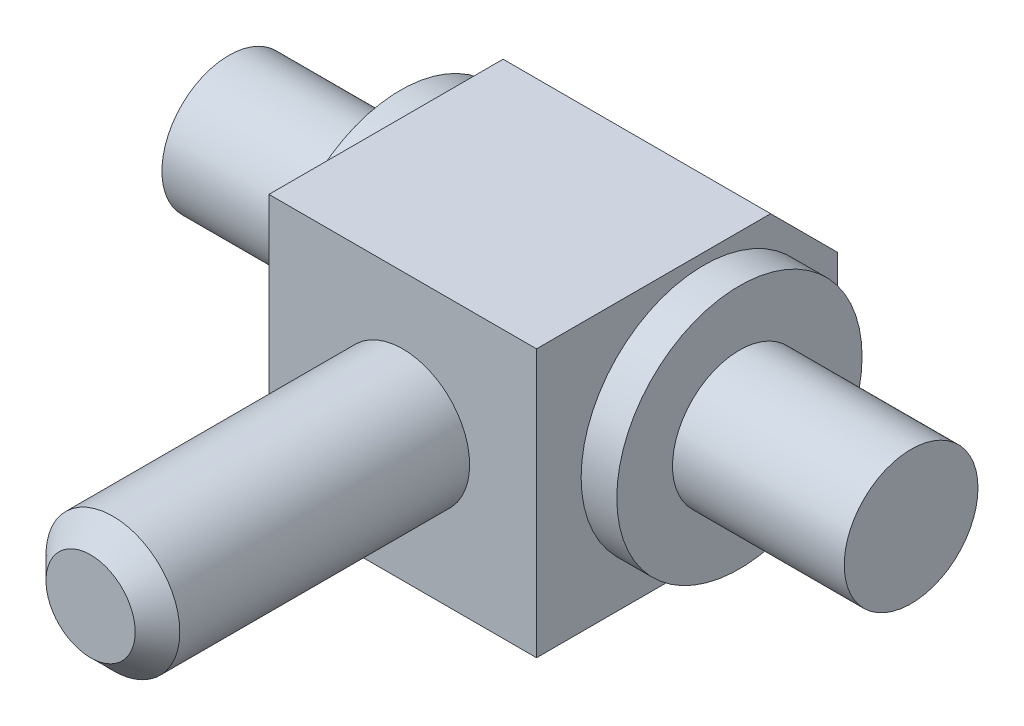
ISO-10303-21;
HEADER;
FILE_DESCRIPTION(('STEP AP214'),'2;1');
FILE_NAME('part.step','',(''),(''),'','','');
FILE_SCHEMA(('AUTOMOTIVE_DESIGN { 1 0 10303 214 1 1 1 1 }'));
ENDSEC;
DATA;
#1=APPLICATION_CONTEXT('core data for automotive mechanical design processes');
#2=APPLICATION_PROTOCOL_DEFINITION('international standard','automotive_design',2000,#1);
#3=PRODUCT_CONTEXT('',#1,'mechanical');
#4=PRODUCT('Part','Part','',(#3));
#5=PRODUCT_RELATED_PRODUCT_CATEGORY('part','',(#4));
#6=PRODUCT_DEFINITION_FORMATION('','',#4);
#7=PRODUCT_DEFINITION_CONTEXT('part definition',#1,'design');
#8=PRODUCT_DEFINITION('design','',#6,#7);
#9=PRODUCT_DEFINITION_SHAPE('','',#8);
#10=(LENGTH_UNIT() NAMED_UNIT(*) SI_UNIT(.MILLI.,.METRE.));
#11=(NAMED_UNIT(*) PLANE_ANGLE_UNIT() SI_UNIT($,.RADIAN.));
#12=(NAMED_UNIT(*) SI_UNIT($,.STERADIAN.) SOLID_ANGLE_UNIT());
#13=UNCERTAINTY_MEASURE_WITH_UNIT(LENGTH_MEASURE(1.E-05),#10,'distance_accuracy_value','');
#14=(GEOMETRIC_REPRESENTATION_CONTEXT(3) GLOBAL_UNCERTAINTY_ASSIGNED_CONTEXT((#13)) GLOBAL_UNIT_ASSIGNED_CONTEXT((#10,
#11,#12)) REPRESENTATION_CONTEXT('',''));
#15=CARTESIAN_POINT('',(0.,0.,0.));
#16=DIRECTION('',(0.,0.,1.));
#17=DIRECTION('',(1.,0.,0.));
#18=AXIS2_PLACEMENT_3D('',#15,#16,#17);
#19=CARTESIAN_POINT('',(-6.,6.,7.));
#20=DIRECTION('',(1.,0.,0.));
#21=DIRECTION('',(0.,0.,1.));
#22=AXIS2_PLACEMENT_3D('',#19,#20,#21);
#23=PLANE('',#22);
#24=DIRECTION('',(0.,1.,0.));
#25=VECTOR('',#24,1.);
#26=CARTESIAN_POINT('',(-6.,-6.,-6.));
#27=LINE('',#26,#25);
#28=CARTESIAN_POINT('',(-6.,-3.,-6.));
#29=VERTEX_POINT('',#28);
#30=CARTESIAN_POINT('',(-6.,2.99999999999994,-6.));
#31=VERTEX_POINT('',#30);
#32=EDGE_CURVE('E120',#29,#31,#27,.T.);
#33=ORIENTED_EDGE('',*,*,#32,.F.);
#34=DIRECTION('',(0.,-0.707106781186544,0.707106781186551));
#35=VECTOR('',#34,1.);
#36=CARTESIAN_POINT('',(-6.,-6.,-3.));
#37=LINE('',#36,#35);
#38=CARTESIAN_POINT('',(-6.,-6.,-3.));
#39=VERTEX_POINT('',#38);
#40=EDGE_CURVE('E135',#29,#39,#37,.T.);
#41=ORIENTED_EDGE('',*,*,#40,.T.);
#42=DIRECTION('',(0.,0.,1.));
#43=VECTOR('',#42,1.);
#44=CARTESIAN_POINT('',(-6.,-6.,-6.));
#45=LINE('',#44,#43);
#46=CARTESIAN_POINT('',(-6.,-6.,7.5));
#47=VERTEX_POINT('',#46);
#48=EDGE_CURVE('E77',#39,#47,#45,.T.);
#49=ORIENTED_EDGE('',*,*,#48,.T.);
#50=DIRECTION('',(0.,-1.,0.));
#51=VECTOR('',#50,1.);
#52=CARTESIAN_POINT('',(-6.,6.,7.5));
#53=LINE('',#52,#51);
#54=CARTESIAN_POINT('',(-6.,6.,7.5));
#55=VERTEX_POINT('',#54);
#56=EDGE_CURVE('E87',#55,#47,#53,.T.);
#57=ORIENTED_EDGE('',*,*,#56,.F.);
#58=DIRECTION('',(0.,0.,-1.));
#59=VECTOR('',#58,1.);
#60=CARTESIAN_POINT('',(-6.,6.,7.));
#61=LINE('',#60,#59);
#62=CARTESIAN_POINT('',(-6.,6.,-3.));
#63=VERTEX_POINT('',#62);
#64=EDGE_CURVE('E83',#55,#63,#61,.T.);
#65=ORIENTED_EDGE('',*,*,#64,.T.);
#66=DIRECTION('',(0.,-0.707106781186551,-0.707106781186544));
#67=VECTOR('',#66,1.);
#68=CARTESIAN_POINT('',(-6.,2.99999999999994,-6.));
#69=LINE('',#68,#67);
#70=EDGE_CURVE('E36',#63,#31,#69,.T.);
#71=ORIENTED_EDGE('',*,*,#70,.T.);
#72=EDGE_LOOP('',(#33,#41,#49,#57,#65,#71));
#73=FACE_BOUND('',#72,.T.);
#74=CARTESIAN_POINT('',(-6.,0.,0.));
#75=DIRECTION('',(1.,0.,0.));
#76=DIRECTION('',(0.,0.,1.));
#77=AXIS2_PLACEMENT_3D('',#74,#75,#76);
#78=CIRCLE('',#77,5.5);
#79=CARTESIAN_POINT('',(-6.,0.,5.5));
#80=VERTEX_POINT('',#79);
#81=EDGE_CURVE('E105',#80,#80,#78,.F.);
#82=ORIENTED_EDGE('',*,*,#81,.F.);
#83=EDGE_LOOP('',(#82));
#84=FACE_BOUND('',#83,.T.);
#85=ADVANCED_FACE('F14',(#73,#84),#23,.F.);
#86=CARTESIAN_POINT('',(6.,6.,7.));
#87=DIRECTION('',(1.,0.,0.));
#88=DIRECTION('',(0.,0.,1.));
#89=AXIS2_PLACEMENT_3D('',#86,#87,#88);
#90=PLANE('',#89);
#91=DIRECTION('',(0.,0.,1.));
#92=VECTOR('',#91,1.);
#93=CARTESIAN_POINT('',(6.,-6.,-6.));
#94=LINE('',#93,#92);
#95=CARTESIAN_POINT('',(6.,-6.,-3.));
#96=VERTEX_POINT('',#95);
#97=CARTESIAN_POINT('',(6.,-6.,7.5));
#98=VERTEX_POINT('',#97);
#99=EDGE_CURVE('E116',#96,#98,#94,.T.);
#100=ORIENTED_EDGE('',*,*,#99,.F.);
#101=DIRECTION('',(0.,0.707106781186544,-0.707106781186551));
#102=VECTOR('',#101,1.);
#103=CARTESIAN_POINT('',(6.,-5.,-4.));
#104=LINE('',#103,#102);
#105=CARTESIAN_POINT('',(6.,-3.,-6.));
#106=VERTEX_POINT('',#105);
#107=EDGE_CURVE('E127',#96,#106,#104,.T.);
#108=ORIENTED_EDGE('',*,*,#107,.T.);
#109=DIRECTION('',(0.,1.,0.));
#110=VECTOR('',#109,1.);
#111=CARTESIAN_POINT('',(6.,-6.,-6.));
#112=LINE('',#111,#110);
#113=CARTESIAN_POINT('',(6.,2.99999999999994,-6.));
#114=VERTEX_POINT('',#113);
#115=EDGE_CURVE('E78',#106,#114,#112,.T.);
#116=ORIENTED_EDGE('',*,*,#115,.T.);
#117=DIRECTION('',(0.,0.707106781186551,0.707106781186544));
#118=VECTOR('',#117,1.);
#119=CARTESIAN_POINT('',(6.,11.,2.));
#120=LINE('',#119,#118);
#121=CARTESIAN_POINT('',(6.,6.,-3.));
#122=VERTEX_POINT('',#121);
#123=EDGE_CURVE('E76',#114,#122,#120,.T.);
#124=ORIENTED_EDGE('',*,*,#123,.T.);
#125=DIRECTION('',(0.,0.,-1.));
#126=VECTOR('',#125,1.);
#127=CARTESIAN_POINT('',(6.,6.,7.));
#128=LINE('',#127,#126);
#129=CARTESIAN_POINT('',(6.,6.,7.5));
#130=VERTEX_POINT('',#129);
#131=EDGE_CURVE('E68',#130,#122,#128,.T.);
#132=ORIENTED_EDGE('',*,*,#131,.F.);
#133=DIRECTION('',(0.,1.,0.));
#134=VECTOR('',#133,1.);
#135=CARTESIAN_POINT('',(6.,-6.,7.5));
#136=LINE('',#135,#134);
#137=EDGE_CURVE('E74',#98,#130,#136,.T.);
#138=ORIENTED_EDGE('',*,*,#137,.F.);
#139=EDGE_LOOP('',(#100,#108,#116,#124,#132,#138));
#140=FACE_BOUND('',#139,.T.);
#141=CARTESIAN_POINT('',(6.,0.,0.));
#142=DIRECTION('',(1.,0.,0.));
#143=DIRECTION('',(0.,0.,1.));
#144=AXIS2_PLACEMENT_3D('',#141,#142,#143);
#145=CIRCLE('',#144,5.5);
#146=CARTESIAN_POINT('',(6.,0.,5.5));
#147=VERTEX_POINT('',#146);
#148=EDGE_CURVE('E113',#147,#147,#145,.F.);
#149=ORIENTED_EDGE('',*,*,#148,.T.);
#150=EDGE_LOOP('',(#149));
#151=FACE_BOUND('',#150,.T.);
#152=ADVANCED_FACE('F71',(#140,#151),#90,.T.);
#153=CARTESIAN_POINT('',(-6.,6.,7.));
#154=DIRECTION('',(0.,-1.,0.));
#155=DIRECTION('',(-1.,0.,0.));
#156=AXIS2_PLACEMENT_3D('',#153,#154,#155);
#157=PLANE('',#156);
#158=ORIENTED_EDGE('',*,*,#131,.T.);
#159=DIRECTION('',(-1.,0.,0.));
#160=VECTOR('',#159,1.);
#161=CARTESIAN_POINT('',(-6.,6.,-3.));
#162=LINE('',#161,#160);
#163=EDGE_CURVE('E29',#122,#63,#162,.T.);
#164=ORIENTED_EDGE('',*,*,#163,.T.);
#165=ORIENTED_EDGE('',*,*,#64,.F.);
#166=DIRECTION('',(-1.,0.,0.));
#167=VECTOR('',#166,1.);
#168=CARTESIAN_POINT('',(6.,6.,7.5));
#169=LINE('',#168,#167);
#170=EDGE_CURVE('E81',#130,#55,#169,.T.);
#171=ORIENTED_EDGE('',*,*,#170,.F.);
#172=EDGE_LOOP('',(#158,#164,#165,#171));
#173=FACE_BOUND('',#172,.T.);
#174=ADVANCED_FACE('F82',(#173),#157,.F.);
#175=CARTESIAN_POINT('',(-6.,-6.,-6.));
#176=DIRECTION('',(0.,0.,-1.));
#177=DIRECTION('',(1.,0.,0.));
#178=AXIS2_PLACEMENT_3D('',#175,#176,#177);
#179=PLANE('',#178);
#180=ORIENTED_EDGE('',*,*,#115,.F.);
#181=DIRECTION('',(-1.,0.,0.));
#182=VECTOR('',#181,1.);
#183=CARTESIAN_POINT('',(-6.,-3.,-6.));
#184=LINE('',#183,#182);
#185=EDGE_CURVE('E132',#106,#29,#184,.T.);
#186=ORIENTED_EDGE('',*,*,#185,.T.);
#187=ORIENTED_EDGE('',*,*,#32,.T.);
#188=DIRECTION('',(1.,0.,0.));
#189=VECTOR('',#188,1.);
#190=CARTESIAN_POINT('',(6.,2.99999999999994,-6.));
#191=LINE('',#190,#189);
#192=EDGE_CURVE('E129',#31,#114,#191,.T.);
#193=ORIENTED_EDGE('',*,*,#192,.T.);
#194=EDGE_LOOP('',(#180,#186,#187,#193));
#195=FACE_BOUND('',#194,.T.);
#196=ADVANCED_FACE('F172',(#195),#179,.T.);
#197=CARTESIAN_POINT('',(-6.,-6.,-6.));
#198=DIRECTION('',(0.,1.,0.));
#199=DIRECTION('',(0.,0.,-1.));
#200=AXIS2_PLACEMENT_3D('',#197,#198,#199);
#201=PLANE('',#200);
#202=ORIENTED_EDGE('',*,*,#48,.F.);
#203=DIRECTION('',(1.,0.,0.));
#204=VECTOR('',#203,1.);
#205=CARTESIAN_POINT('',(6.,-6.,-3.));
#206=LINE('',#205,#204);
#207=EDGE_CURVE('E123',#39,#96,#206,.T.);
#208=ORIENTED_EDGE('',*,*,#207,.T.);
#209=ORIENTED_EDGE('',*,*,#99,.T.);
#210=DIRECTION('',(1.,0.,0.));
#211=VECTOR('',#210,1.);
#212=CARTESIAN_POINT('',(-6.,-6.,7.5));
#213=LINE('',#212,#211);
#214=EDGE_CURVE('E92',#47,#98,#213,.T.);
#215=ORIENTED_EDGE('',*,*,#214,.F.);
#216=EDGE_LOOP('',(#202,#208,#209,#215));
#217=FACE_BOUND('',#216,.T.);
#218=ADVANCED_FACE('F168',(#217),#201,.F.);
#219=CARTESIAN_POINT('',(-6.,-6.,-3.));
#220=DIRECTION('',(0.,-0.707106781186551,-0.707106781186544));
#221=DIRECTION('',(0.,-0.707106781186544,0.707106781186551));
#222=AXIS2_PLACEMENT_3D('',#219,#220,#221);
#223=PLANE('',#222);
#224=ORIENTED_EDGE('',*,*,#40,.F.);
#225=ORIENTED_EDGE('',*,*,#185,.F.);
#226=ORIENTED_EDGE('',*,*,#107,.F.);
#227=ORIENTED_EDGE('',*,*,#207,.F.);
#228=EDGE_LOOP('',(#224,#225,#226,#227));
#229=FACE_BOUND('',#228,.T.);
#230=ADVANCED_FACE('F171',(#229),#223,.T.);
#231=CARTESIAN_POINT('',(-6.,2.99999999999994,-6.));
#232=DIRECTION('',(0.,0.707106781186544,-0.707106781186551));
#233=DIRECTION('',(0.,-0.707106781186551,-0.707106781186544));
#234=AXIS2_PLACEMENT_3D('',#231,#232,#233);
#235=PLANE('',#234);
#236=ORIENTED_EDGE('',*,*,#70,.F.);
#237=ORIENTED_EDGE('',*,*,#163,.F.);
#238=ORIENTED_EDGE('',*,*,#123,.F.);
#239=ORIENTED_EDGE('',*,*,#192,.F.);
#240=EDGE_LOOP('',(#236,#237,#238,#239));
#241=FACE_BOUND('',#240,.T.);
#242=ADVANCED_FACE('F200',(#241),#235,.T.);
#243=CARTESIAN_POINT('',(-7.6,0.,0.));
#244=DIRECTION('',(-1.,0.,0.));
#245=DIRECTION('',(0.,0.,-1.));
#246=AXIS2_PLACEMENT_3D('',#243,#244,#245);
#247=PLANE('',#246);
#248=CARTESIAN_POINT('',(-7.6,0.,0.));
#249=DIRECTION('',(-1.,0.,0.));
#250=DIRECTION('',(0.,0.,-1.));
#251=AXIS2_PLACEMENT_3D('',#248,#249,#250);
#252=CIRCLE('',#251,5.5);
#253=CARTESIAN_POINT('',(-7.6,0.,-5.5));
#254=VERTEX_POINT('',#253);
#255=EDGE_CURVE('E101',#254,#254,#252,.T.);
#256=ORIENTED_EDGE('',*,*,#255,.T.);
#257=EDGE_LOOP('',(#256));
#258=FACE_BOUND('',#257,.T.);
#259=CARTESIAN_POINT('',(-7.6,0.,0.));
#260=DIRECTION('',(-1.,0.,0.));
#261=DIRECTION('',(0.,0.,-1.));
#262=AXIS2_PLACEMENT_3D('',#259,#260,#261);
#263=CIRCLE('',#262,3.);
#264=CARTESIAN_POINT('',(-7.6,0.,-3.));
#265=VERTEX_POINT('',#264);
#266=EDGE_CURVE('E104',#265,#265,#263,.T.);
#267=ORIENTED_EDGE('',*,*,#266,.F.);
#268=EDGE_LOOP('',(#267));
#269=FACE_BOUND('',#268,.T.);
#270=ADVANCED_FACE('F208',(#258,#269),#247,.T.);
#271=CARTESIAN_POINT('',(-7.6,0.,0.));
#272=DIRECTION('',(1.,0.,0.));
#273=DIRECTION('',(0.,0.,1.));
#274=AXIS2_PLACEMENT_3D('',#271,#272,#273);
#275=CYLINDRICAL_SURFACE('',#274,5.5);
#276=ORIENTED_EDGE('',*,*,#255,.F.);
#277=EDGE_LOOP('',(#276));
#278=FACE_BOUND('',#277,.T.);
#279=ORIENTED_EDGE('',*,*,#81,.T.);
#280=EDGE_LOOP('',(#279));
#281=FACE_BOUND('',#280,.T.);
#282=ADVANCED_FACE('F217',(#278,#281),#275,.T.);
#283=CARTESIAN_POINT('',(7.6,0.,0.));
#284=DIRECTION('',(-1.,0.,0.));
#285=DIRECTION('',(0.,0.,-1.));
#286=AXIS2_PLACEMENT_3D('',#283,#284,#285);
#287=PLANE('',#286);
#288=CARTESIAN_POINT('',(7.6,0.,0.));
#289=DIRECTION('',(-1.,0.,0.));
#290=DIRECTION('',(0.,0.,-1.));
#291=AXIS2_PLACEMENT_3D('',#288,#289,#290);
#292=CIRCLE('',#291,5.5);
#293=CARTESIAN_POINT('',(7.6,0.,-5.5));
#294=VERTEX_POINT('',#293);
#295=EDGE_CURVE('E98',#294,#294,#292,.T.);
#296=ORIENTED_EDGE('',*,*,#295,.F.);
#297=EDGE_LOOP('',(#296));
#298=FACE_BOUND('',#297,.T.);
#299=CARTESIAN_POINT('',(7.6,0.,0.));
#300=DIRECTION('',(-1.,0.,0.));
#301=DIRECTION('',(0.,0.,-1.));
#302=AXIS2_PLACEMENT_3D('',#299,#300,#301);
#303=CIRCLE('',#302,3.);
#304=CARTESIAN_POINT('',(7.6,0.,-3.));
#305=VERTEX_POINT('',#304);
#306=EDGE_CURVE('E108',#305,#305,#303,.T.);
#307=ORIENTED_EDGE('',*,*,#306,.T.);
#308=EDGE_LOOP('',(#307));
#309=FACE_BOUND('',#308,.T.);
#310=ADVANCED_FACE('F226',(#298,#309),#287,.F.);
#311=ORIENTED_EDGE('',*,*,#148,.F.);
#312=EDGE_LOOP('',(#311));
#313=FACE_BOUND('',#312,.T.);
#314=ORIENTED_EDGE('',*,*,#295,.T.);
#315=EDGE_LOOP('',(#314));
#316=FACE_BOUND('',#315,.T.);
#317=ADVANCED_FACE('F229',(#313,#316),#275,.T.);
#318=CARTESIAN_POINT('',(15.3,0.,0.));
#319=DIRECTION('',(-1.,0.,0.));
#320=DIRECTION('',(0.,0.,-1.));
#321=AXIS2_PLACEMENT_3D('',#318,#319,#320);
#322=PLANE('',#321);
#323=CARTESIAN_POINT('',(15.3,0.,0.));
#324=DIRECTION('',(-1.,0.,0.));
#325=DIRECTION('',(0.,0.,-1.));
#326=AXIS2_PLACEMENT_3D('',#323,#324,#325);
#327=CIRCLE('',#326,3.);
#328=CARTESIAN_POINT('',(15.3,0.,-3.));
#329=VERTEX_POINT('',#328);
#330=EDGE_CURVE('E109',#329,#329,#327,.T.);
#331=ORIENTED_EDGE('',*,*,#330,.F.);
#332=EDGE_LOOP('',(#331));
#333=FACE_BOUND('',#332,.T.);
#334=ADVANCED_FACE('F244',(#333),#322,.F.);
#335=CARTESIAN_POINT('',(-15.3,0.,0.));
#336=DIRECTION('',(1.,0.,0.));
#337=DIRECTION('',(0.,0.,1.));
#338=AXIS2_PLACEMENT_3D('',#335,#336,#337);
#339=CYLINDRICAL_SURFACE('',#338,3.);
#340=ORIENTED_EDGE('',*,*,#330,.T.);
#341=EDGE_LOOP('',(#340));
#342=FACE_BOUND('',#341,.T.);
#343=ORIENTED_EDGE('',*,*,#306,.F.);
#344=EDGE_LOOP('',(#343));
#345=FACE_BOUND('',#344,.T.);
#346=ADVANCED_FACE('F252',(#342,#345),#339,.T.);
#347=CARTESIAN_POINT('',(-15.3,0.,0.));
#348=DIRECTION('',(-1.,0.,0.));
#349=DIRECTION('',(0.,0.,-1.));
#350=AXIS2_PLACEMENT_3D('',#347,#348,#349);
#351=PLANE('',#350);
#352=CARTESIAN_POINT('',(-15.3,0.,0.));
#353=DIRECTION('',(-1.,0.,0.));
#354=DIRECTION('',(0.,0.,-1.));
#355=AXIS2_PLACEMENT_3D('',#352,#353,#354);
#356=CIRCLE('',#355,3.);
#357=CARTESIAN_POINT('',(-15.3,0.,-3.));
#358=VERTEX_POINT('',#357);
#359=EDGE_CURVE('E112',#358,#358,#356,.T.);
#360=ORIENTED_EDGE('',*,*,#359,.T.);
#361=EDGE_LOOP('',(#360));
#362=FACE_BOUND('',#361,.T.);
#363=ADVANCED_FACE('F261',(#362),#351,.T.);
#364=ORIENTED_EDGE('',*,*,#266,.T.);
#365=EDGE_LOOP('',(#364));
#366=FACE_BOUND('',#365,.T.);
#367=ORIENTED_EDGE('',*,*,#359,.F.);
#368=EDGE_LOOP('',(#367));
#369=FACE_BOUND('',#368,.T.);
#370=ADVANCED_FACE('F264',(#366,#369),#339,.T.);
#371=CARTESIAN_POINT('',(0.,0.,7.5));
#372=DIRECTION('',(0.,0.,1.));
#373=DIRECTION('',(1.,0.,0.));
#374=AXIS2_PLACEMENT_3D('',#371,#372,#373);
#375=PLANE('',#374);
#376=CARTESIAN_POINT('',(0.,0.,7.5));
#377=DIRECTION('',(0.,0.,1.));
#378=DIRECTION('',(1.,0.,0.));
#379=AXIS2_PLACEMENT_3D('',#376,#377,#378);
#380=CIRCLE('',#379,3.);
#381=CARTESIAN_POINT('',(3.,0.,7.5));
#382=VERTEX_POINT('',#381);
#383=EDGE_CURVE('E97',#382,#382,#380,.T.);
#384=ORIENTED_EDGE('',*,*,#383,.F.);
#385=EDGE_LOOP('',(#384));
#386=FACE_BOUND('',#385,.T.);
#387=ORIENTED_EDGE('',*,*,#137,.T.);
#388=ORIENTED_EDGE('',*,*,#170,.T.);
#389=ORIENTED_EDGE('',*,*,#56,.T.);
#390=ORIENTED_EDGE('',*,*,#214,.T.);
#391=EDGE_LOOP('',(#387,#388,#389,#390));
#392=FACE_BOUND('',#391,.T.);
#393=ADVANCED_FACE('F90',(#386,#392),#375,.T.);
#394=CARTESIAN_POINT('',(0.,0.,17.));
#395=DIRECTION('',(0.,0.,-1.));
#396=DIRECTION('',(1.,0.,0.));
#397=AXIS2_PLACEMENT_3D('',#394,#395,#396);
#398=CYLINDRICAL_SURFACE('',#397,3.);
#399=CARTESIAN_POINT('',(0.,0.,20.5));
#400=DIRECTION('',(0.,0.,1.));
#401=DIRECTION('',(1.,0.,0.));
#402=AXIS2_PLACEMENT_3D('',#399,#400,#401);
#403=CIRCLE('',#402,3.);
#404=CARTESIAN_POINT('',(3.,0.,20.5));
#405=VERTEX_POINT('',#404);
#406=EDGE_CURVE('E9',#405,#405,#403,.F.);
#407=ORIENTED_EDGE('',*,*,#406,.T.);
#408=EDGE_LOOP('',(#407));
#409=FACE_BOUND('',#408,.T.);
#410=ORIENTED_EDGE('',*,*,#383,.T.);
#411=EDGE_LOOP('',(#410));
#412=FACE_BOUND('',#411,.T.);
#413=ADVANCED_FACE('F156',(#409,#412),#398,.T.);
#414=CARTESIAN_POINT('',(0.,0.,21.5));
#415=DIRECTION('',(0.,0.,1.));
#416=DIRECTION('',(1.,0.,0.));
#417=AXIS2_PLACEMENT_3D('',#414,#415,#416);
#418=PLANE('',#417);
#419=CARTESIAN_POINT('',(0.,0.,21.5));
#420=DIRECTION('',(0.,0.,1.));
#421=DIRECTION('',(1.,0.,0.));
#422=AXIS2_PLACEMENT_3D('',#419,#420,#421);
#423=CIRCLE('',#422,2.);
#424=CARTESIAN_POINT('',(2.,0.,21.5));
#425=VERTEX_POINT('',#424);
#426=EDGE_CURVE('E22',#425,#425,#423,.T.);
#427=ORIENTED_EDGE('',*,*,#426,.T.);
#428=EDGE_LOOP('',(#427));
#429=FACE_BOUND('',#428,.T.);
#430=ADVANCED_FACE('F148',(#429),#418,.T.);
#431=CARTESIAN_POINT('',(0.,0.,21.5));
#432=DIRECTION('',(0.,0.,-1.));
#433=DIRECTION('',(-1.,0.,0.));
#434=AXIS2_PLACEMENT_3D('',#431,#432,#433);
#435=CONICAL_SURFACE('',#434,2.,0.78539816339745);
#436=ORIENTED_EDGE('',*,*,#406,.F.);
#437=EDGE_LOOP('',(#436));
#438=FACE_BOUND('',#437,.T.);
#439=ORIENTED_EDGE('',*,*,#426,.F.);
#440=EDGE_LOOP('',(#439));
#441=FACE_BOUND('',#440,.T.);
#442=ADVANCED_FACE('F16',(#438,#441),#435,.T.);
#443=CLOSED_SHELL('',(#85,#152,#174,#196,#218,#230,#242,#270,#282,#310,#317,#334,#346,#363,#370,
#393,#413,#430,#442));
#444=MANIFOLD_SOLID_BREP('B1',#443);
#445=ADVANCED_BREP_SHAPE_REPRESENTATION('',(#18,#444),#14);
#446=SHAPE_DEFINITION_REPRESENTATION(#9,#445);
ENDSEC;
END-ISO-10303-21;
